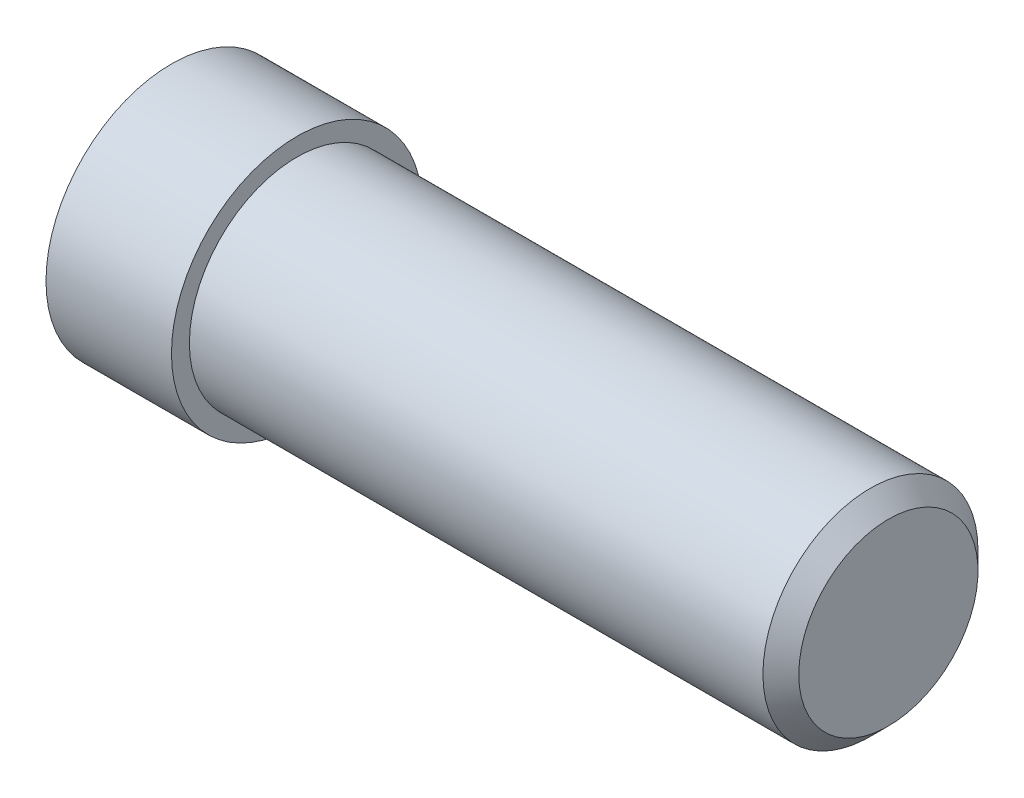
from build123d import *

# Parameters (mm, degrees)
CHAMFER1_SIZE = 1
SCALE1_SCALE  = 0.75


with BuildPart() as part:
    # Sketch1 → Revolve1 (revolve)
    with BuildSketch(Plane.XY, mode=Mode.PRIVATE) as revolve1_sk:
        Polygon((-41.050847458, 26.110169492), (-8.050847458, 26.110169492), (-8.050847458, 20.110169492), (-41.050847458, 20.110169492), (-48.050847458, 20.110169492), (-48.050847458, 27.110169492), (-41.050847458, 27.110169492), align=None)
    revolve(revolve1_sk.sketch.rotate(Axis((-48.881355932, 20.110169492, 0), (1, 0, 0)), 90), axis=Axis((-48.881355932, 20.110169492, 0), (1, 0, 0)))

    # Chamfer1
    chamfer1_edges = [part.edges().sort_by_distance(p)[0] for p in [
        (-8.050847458, 20.110169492, -6),
    ]]
    chamfer(chamfer1_edges, length=CHAMFER1_SIZE)


with BuildPart() as part_1:
    # Scale1: scaled about (-29.108266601, 20.110169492, 0)
    add(part.part.scale(SCALE1_SCALE).moved(Location((-7.27706665, 5.027542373, 0))))


solid = part_1.part
